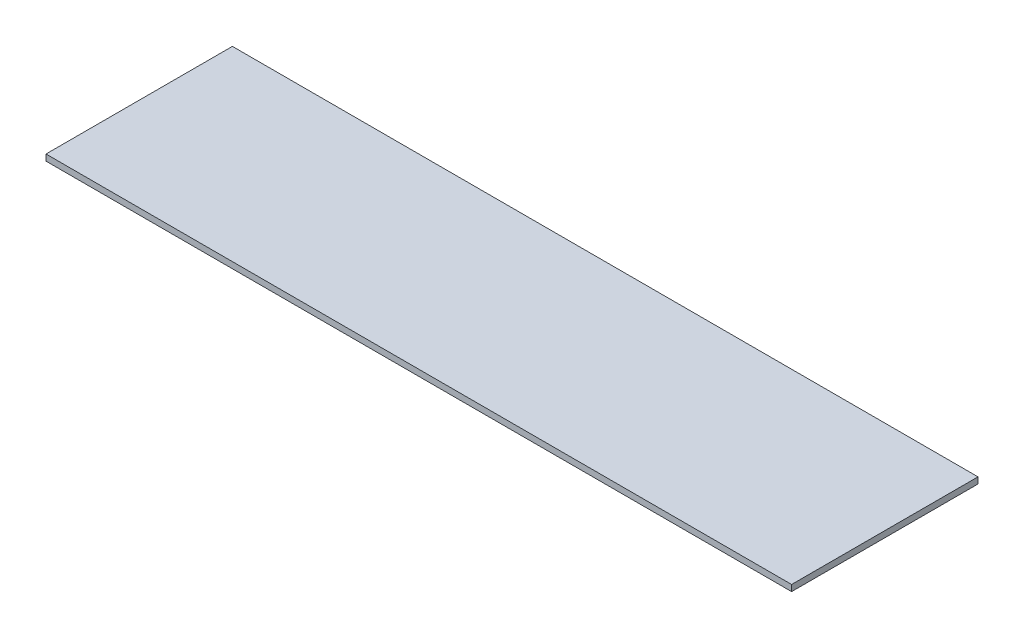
ISO-10303-21;
HEADER;
FILE_DESCRIPTION(('STEP AP214'),'2;1');
FILE_NAME('part.step','',(''),(''),'','','');
FILE_SCHEMA(('AUTOMOTIVE_DESIGN { 1 0 10303 214 1 1 1 1 }'));
ENDSEC;
DATA;
#1=APPLICATION_CONTEXT('core data for automotive mechanical design processes');
#2=APPLICATION_PROTOCOL_DEFINITION('international standard','automotive_design',2000,#1);
#3=PRODUCT_CONTEXT('',#1,'mechanical');
#4=PRODUCT('Part','Part','',(#3));
#5=PRODUCT_RELATED_PRODUCT_CATEGORY('part','',(#4));
#6=PRODUCT_DEFINITION_FORMATION('','',#4);
#7=PRODUCT_DEFINITION_CONTEXT('part definition',#1,'design');
#8=PRODUCT_DEFINITION('design','',#6,#7);
#9=PRODUCT_DEFINITION_SHAPE('','',#8);
#10=(LENGTH_UNIT() NAMED_UNIT(*) SI_UNIT(.MILLI.,.METRE.));
#11=(NAMED_UNIT(*) PLANE_ANGLE_UNIT() SI_UNIT($,.RADIAN.));
#12=(NAMED_UNIT(*) SI_UNIT($,.STERADIAN.) SOLID_ANGLE_UNIT());
#13=UNCERTAINTY_MEASURE_WITH_UNIT(LENGTH_MEASURE(1.E-05),#10,'distance_accuracy_value','');
#14=(GEOMETRIC_REPRESENTATION_CONTEXT(3) GLOBAL_UNCERTAINTY_ASSIGNED_CONTEXT((#13)) GLOBAL_UNIT_ASSIGNED_CONTEXT((#10,
#11,#12)) REPRESENTATION_CONTEXT('',''));
#15=CARTESIAN_POINT('',(0.,0.,0.));
#16=DIRECTION('',(0.,0.,1.));
#17=DIRECTION('',(1.,0.,0.));
#18=AXIS2_PLACEMENT_3D('',#15,#16,#17);
#19=CARTESIAN_POINT('',(-60.,1.,15.));
#20=DIRECTION('',(-1.,0.,0.));
#21=DIRECTION('',(0.,0.,1.));
#22=AXIS2_PLACEMENT_3D('',#19,#20,#21);
#23=PLANE('',#22);
#24=DIRECTION('',(0.,0.,-1.));
#25=VECTOR('',#24,1.);
#26=CARTESIAN_POINT('',(-60.,0.,15.));
#27=LINE('',#26,#25);
#28=CARTESIAN_POINT('',(-60.,0.,15.));
#29=VERTEX_POINT('',#28);
#30=CARTESIAN_POINT('',(-60.,0.,-15.));
#31=VERTEX_POINT('',#30);
#32=EDGE_CURVE('E104',#29,#31,#27,.T.);
#33=ORIENTED_EDGE('',*,*,#32,.F.);
#34=DIRECTION('',(0.,-1.,0.));
#35=VECTOR('',#34,1.);
#36=CARTESIAN_POINT('',(-60.,1.,15.));
#37=LINE('',#36,#35);
#38=CARTESIAN_POINT('',(-60.,1.,15.));
#39=VERTEX_POINT('',#38);
#40=EDGE_CURVE('E11',#39,#29,#37,.T.);
#41=ORIENTED_EDGE('',*,*,#40,.F.);
#42=DIRECTION('',(0.,0.,-1.));
#43=VECTOR('',#42,1.);
#44=CARTESIAN_POINT('',(-60.,1.,15.));
#45=LINE('',#44,#43);
#46=CARTESIAN_POINT('',(-60.,1.,-15.));
#47=VERTEX_POINT('',#46);
#48=EDGE_CURVE('E99',#39,#47,#45,.T.);
#49=ORIENTED_EDGE('',*,*,#48,.T.);
#50=DIRECTION('',(0.,-1.,0.));
#51=VECTOR('',#50,1.);
#52=CARTESIAN_POINT('',(-60.,1.,-15.));
#53=LINE('',#52,#51);
#54=EDGE_CURVE('E42',#47,#31,#53,.T.);
#55=ORIENTED_EDGE('',*,*,#54,.T.);
#56=EDGE_LOOP('',(#33,#41,#49,#55));
#57=FACE_BOUND('',#56,.T.);
#58=ADVANCED_FACE('F39',(#57),#23,.T.);
#59=CARTESIAN_POINT('',(-60.,1.,15.));
#60=DIRECTION('',(0.,0.,-1.));
#61=DIRECTION('',(-1.,0.,0.));
#62=AXIS2_PLACEMENT_3D('',#59,#60,#61);
#63=PLANE('',#62);
#64=DIRECTION('',(1.,0.,0.));
#65=VECTOR('',#64,1.);
#66=CARTESIAN_POINT('',(-60.,0.,15.));
#67=LINE('',#66,#65);
#68=CARTESIAN_POINT('',(60.,0.,15.));
#69=VERTEX_POINT('',#68);
#70=EDGE_CURVE('E72',#29,#69,#67,.T.);
#71=ORIENTED_EDGE('',*,*,#70,.T.);
#72=DIRECTION('',(0.,-1.,0.));
#73=VECTOR('',#72,1.);
#74=CARTESIAN_POINT('',(60.,1.,15.));
#75=LINE('',#74,#73);
#76=CARTESIAN_POINT('',(60.,1.,15.));
#77=VERTEX_POINT('',#76);
#78=EDGE_CURVE('E48',#77,#69,#75,.T.);
#79=ORIENTED_EDGE('',*,*,#78,.F.);
#80=DIRECTION('',(1.,0.,0.));
#81=VECTOR('',#80,1.);
#82=CARTESIAN_POINT('',(-60.,1.,15.));
#83=LINE('',#82,#81);
#84=EDGE_CURVE('E89',#39,#77,#83,.T.);
#85=ORIENTED_EDGE('',*,*,#84,.F.);
#86=ORIENTED_EDGE('',*,*,#40,.T.);
#87=EDGE_LOOP('',(#71,#79,#85,#86));
#88=FACE_BOUND('',#87,.T.);
#89=ADVANCED_FACE('F114',(#88),#63,.F.);
#90=CARTESIAN_POINT('',(60.,1.,15.));
#91=DIRECTION('',(-1.,0.,0.));
#92=DIRECTION('',(0.,0.,1.));
#93=AXIS2_PLACEMENT_3D('',#90,#91,#92);
#94=PLANE('',#93);
#95=DIRECTION('',(0.,0.,-1.));
#96=VECTOR('',#95,1.);
#97=CARTESIAN_POINT('',(60.,0.,15.));
#98=LINE('',#97,#96);
#99=CARTESIAN_POINT('',(60.,0.,-15.));
#100=VERTEX_POINT('',#99);
#101=EDGE_CURVE('E96',#69,#100,#98,.T.);
#102=ORIENTED_EDGE('',*,*,#101,.T.);
#103=DIRECTION('',(0.,-1.,0.));
#104=VECTOR('',#103,1.);
#105=CARTESIAN_POINT('',(60.,1.,-15.));
#106=LINE('',#105,#104);
#107=CARTESIAN_POINT('',(60.,1.,-15.));
#108=VERTEX_POINT('',#107);
#109=EDGE_CURVE('E93',#108,#100,#106,.T.);
#110=ORIENTED_EDGE('',*,*,#109,.F.);
#111=DIRECTION('',(0.,0.,-1.));
#112=VECTOR('',#111,1.);
#113=CARTESIAN_POINT('',(60.,1.,15.));
#114=LINE('',#113,#112);
#115=EDGE_CURVE('E84',#77,#108,#114,.T.);
#116=ORIENTED_EDGE('',*,*,#115,.F.);
#117=ORIENTED_EDGE('',*,*,#78,.T.);
#118=EDGE_LOOP('',(#102,#110,#116,#117));
#119=FACE_BOUND('',#118,.T.);
#120=ADVANCED_FACE('F94',(#119),#94,.F.);
#121=CARTESIAN_POINT('',(-60.,1.,-15.));
#122=DIRECTION('',(0.,0.,-1.));
#123=DIRECTION('',(-1.,0.,0.));
#124=AXIS2_PLACEMENT_3D('',#121,#122,#123);
#125=PLANE('',#124);
#126=DIRECTION('',(1.,0.,0.));
#127=VECTOR('',#126,1.);
#128=CARTESIAN_POINT('',(-60.,0.,-15.));
#129=LINE('',#128,#127);
#130=EDGE_CURVE('E107',#31,#100,#129,.T.);
#131=ORIENTED_EDGE('',*,*,#130,.F.);
#132=ORIENTED_EDGE('',*,*,#54,.F.);
#133=DIRECTION('',(1.,0.,0.));
#134=VECTOR('',#133,1.);
#135=CARTESIAN_POINT('',(-60.,1.,-15.));
#136=LINE('',#135,#134);
#137=EDGE_CURVE('E88',#47,#108,#136,.T.);
#138=ORIENTED_EDGE('',*,*,#137,.T.);
#139=ORIENTED_EDGE('',*,*,#109,.T.);
#140=EDGE_LOOP('',(#131,#132,#138,#139));
#141=FACE_BOUND('',#140,.T.);
#142=ADVANCED_FACE('F98',(#141),#125,.T.);
#143=CARTESIAN_POINT('',(0.,1.,0.));
#144=DIRECTION('',(0.,-1.,0.));
#145=DIRECTION('',(0.,0.,-1.));
#146=AXIS2_PLACEMENT_3D('',#143,#144,#145);
#147=PLANE('',#146);
#148=ORIENTED_EDGE('',*,*,#48,.F.);
#149=ORIENTED_EDGE('',*,*,#84,.T.);
#150=ORIENTED_EDGE('',*,*,#115,.T.);
#151=ORIENTED_EDGE('',*,*,#137,.F.);
#152=EDGE_LOOP('',(#148,#149,#150,#151));
#153=FACE_BOUND('',#152,.T.);
#154=ADVANCED_FACE('F87',(#153),#147,.F.);
#155=CARTESIAN_POINT('',(0.,0.,0.));
#156=DIRECTION('',(0.,-1.,0.));
#157=DIRECTION('',(0.,0.,-1.));
#158=AXIS2_PLACEMENT_3D('',#155,#156,#157);
#159=PLANE('',#158);
#160=ORIENTED_EDGE('',*,*,#32,.T.);
#161=ORIENTED_EDGE('',*,*,#130,.T.);
#162=ORIENTED_EDGE('',*,*,#101,.F.);
#163=ORIENTED_EDGE('',*,*,#70,.F.);
#164=EDGE_LOOP('',(#160,#161,#162,#163));
#165=FACE_BOUND('',#164,.T.);
#166=ADVANCED_FACE('F112',(#165),#159,.T.);
#167=CLOSED_SHELL('',(#58,#89,#120,#142,#154,#166));
#168=MANIFOLD_SOLID_BREP('B2',#167);
#169=ADVANCED_BREP_SHAPE_REPRESENTATION('',(#18,#168),#14);
#170=SHAPE_DEFINITION_REPRESENTATION(#9,#169);
ENDSEC;
END-ISO-10303-21;
